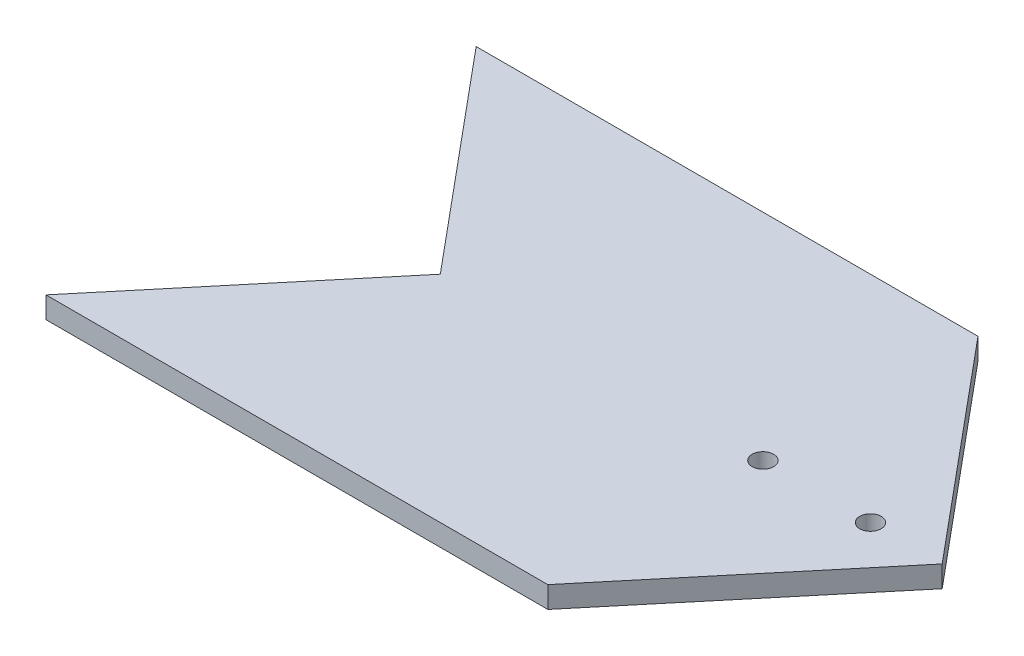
from build123d import *

# Parameters (mm, degrees)
SKETCH1_R      = 1.5
EXTRUDE1_DEPTH = 3


with BuildPart() as part:
    # Sketch1 → Extrude1 (new body)
    with BuildSketch(Plane(origin=(0, 0, 0), x_dir=(1, 0, 0), z_dir=(0, 1, 0))):
        Polygon((0, 0), (70, 0), (95, 30), (70, 60), (0, 60), (25, 30), align=None)
        with Locations(Location((85, 30, 0), (0, 0, 270))):
            Circle(SKETCH1_R, mode=Mode.SUBTRACT)
        with Locations(Location((70, 30, 0), (0, 0, 270))):
            Circle(SKETCH1_R, mode=Mode.SUBTRACT)
    extrude(amount=EXTRUDE1_DEPTH)


solid = part.part
